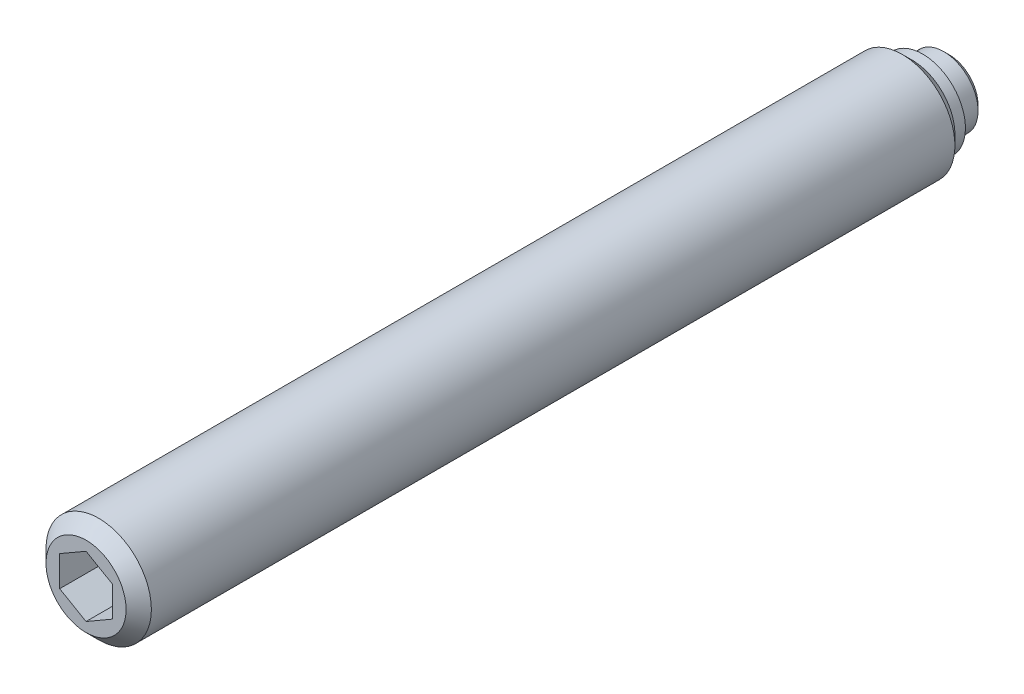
ISO-10303-21;
HEADER;
FILE_DESCRIPTION(('STEP AP214'),'2;1');
FILE_NAME('part.step','',(''),(''),'','','');
FILE_SCHEMA(('AUTOMOTIVE_DESIGN { 1 0 10303 214 1 1 1 1 }'));
ENDSEC;
DATA;
#1=APPLICATION_CONTEXT('core data for automotive mechanical design processes');
#2=APPLICATION_PROTOCOL_DEFINITION('international standard','automotive_design',2000,#1);
#3=PRODUCT_CONTEXT('',#1,'mechanical');
#4=PRODUCT('Part','Part','',(#3));
#5=PRODUCT_RELATED_PRODUCT_CATEGORY('part','',(#4));
#6=PRODUCT_DEFINITION_FORMATION('','',#4);
#7=PRODUCT_DEFINITION_CONTEXT('part definition',#1,'design');
#8=PRODUCT_DEFINITION('design','',#6,#7);
#9=PRODUCT_DEFINITION_SHAPE('','',#8);
#10=(LENGTH_UNIT() NAMED_UNIT(*) SI_UNIT(.MILLI.,.METRE.));
#11=(NAMED_UNIT(*) PLANE_ANGLE_UNIT() SI_UNIT($,.RADIAN.));
#12=(NAMED_UNIT(*) SI_UNIT($,.STERADIAN.) SOLID_ANGLE_UNIT());
#13=UNCERTAINTY_MEASURE_WITH_UNIT(LENGTH_MEASURE(1.E-05),#10,'distance_accuracy_value','');
#14=(GEOMETRIC_REPRESENTATION_CONTEXT(3) GLOBAL_UNCERTAINTY_ASSIGNED_CONTEXT((#13)) GLOBAL_UNIT_ASSIGNED_CONTEXT((#10,
#11,#12)) REPRESENTATION_CONTEXT('',''));
#15=CARTESIAN_POINT('',(0.,0.,0.));
#16=DIRECTION('',(0.,0.,1.));
#17=DIRECTION('',(1.,0.,0.));
#18=AXIS2_PLACEMENT_3D('',#15,#16,#17);
#19=CARTESIAN_POINT('',(0.,0.,0.));
#20=DIRECTION('',(0.,0.,-1.));
#21=DIRECTION('',(-1.,0.,0.));
#22=AXIS2_PLACEMENT_3D('',#19,#20,#21);
#23=CYLINDRICAL_SURFACE('',#22,3.25);
#24=CARTESIAN_POINT('',(0.,0.,0.5));
#25=DIRECTION('',(0.,0.,-1.));
#26=DIRECTION('',(-1.,0.,0.));
#27=AXIS2_PLACEMENT_3D('',#24,#25,#26);
#28=CIRCLE('',#27,3.25);
#29=CARTESIAN_POINT('',(-3.25,0.,0.5));
#30=VERTEX_POINT('',#29);
#31=EDGE_CURVE('E133',#30,#30,#28,.T.);
#32=ORIENTED_EDGE('',*,*,#31,.F.);
#33=EDGE_LOOP('',(#32));
#34=FACE_BOUND('',#33,.T.);
#35=CARTESIAN_POINT('',(0.,0.,2.5));
#36=DIRECTION('',(0.,0.,-1.));
#37=DIRECTION('',(-1.,0.,0.));
#38=AXIS2_PLACEMENT_3D('',#35,#36,#37);
#39=CIRCLE('',#38,3.25);
#40=CARTESIAN_POINT('',(-3.25,0.,2.5));
#41=VERTEX_POINT('',#40);
#42=EDGE_CURVE('E127',#41,#41,#39,.T.);
#43=ORIENTED_EDGE('',*,*,#42,.T.);
#44=EDGE_LOOP('',(#43));
#45=FACE_BOUND('',#44,.T.);
#46=ADVANCED_FACE('F14',(#34,#45),#23,.T.);
#47=CARTESIAN_POINT('',(0.,0.,0.5));
#48=DIRECTION('',(0.,0.,1.));
#49=DIRECTION('',(1.,0.,0.));
#50=AXIS2_PLACEMENT_3D('',#47,#48,#49);
#51=CONICAL_SURFACE('',#50,3.25,0.785398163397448);
#52=CARTESIAN_POINT('',(0.,0.,0.));
#53=DIRECTION('',(0.,0.,-1.));
#54=DIRECTION('',(-1.,0.,0.));
#55=AXIS2_PLACEMENT_3D('',#52,#53,#54);
#56=CIRCLE('',#55,2.75);
#57=CARTESIAN_POINT('',(-2.75,0.,0.));
#58=VERTEX_POINT('',#57);
#59=EDGE_CURVE('E130',#58,#58,#56,.T.);
#60=ORIENTED_EDGE('',*,*,#59,.F.);
#61=EDGE_LOOP('',(#60));
#62=FACE_BOUND('',#61,.T.);
#63=ORIENTED_EDGE('',*,*,#31,.T.);
#64=EDGE_LOOP('',(#63));
#65=FACE_BOUND('',#64,.T.);
#66=ADVANCED_FACE('F159',(#62,#65),#51,.T.);
#67=CARTESIAN_POINT('',(0.,2.75,0.));
#68=DIRECTION('',(0.,0.,1.));
#69=DIRECTION('',(1.,0.,0.));
#70=AXIS2_PLACEMENT_3D('',#67,#68,#69);
#71=PLANE('',#70);
#72=ORIENTED_EDGE('',*,*,#59,.T.);
#73=EDGE_LOOP('',(#72));
#74=FACE_BOUND('',#73,.T.);
#75=ADVANCED_FACE('F165',(#74),#71,.F.);
#76=CARTESIAN_POINT('',(0.,0.,2.5));
#77=DIRECTION('',(0.,0.,-1.));
#78=DIRECTION('',(-1.,0.,0.));
#79=AXIS2_PLACEMENT_3D('',#76,#77,#78);
#80=CYLINDRICAL_SURFACE('',#79,5.);
#81=CARTESIAN_POINT('',(0.,0.,4.45));
#82=DIRECTION('',(0.,0.,-1.));
#83=DIRECTION('',(-1.,0.,0.));
#84=AXIS2_PLACEMENT_3D('',#81,#82,#83);
#85=CIRCLE('',#84,5.);
#86=CARTESIAN_POINT('',(-5.,0.,4.45));
#87=VERTEX_POINT('',#86);
#88=EDGE_CURVE('E9',#87,#87,#85,.T.);
#89=ORIENTED_EDGE('',*,*,#88,.F.);
#90=EDGE_LOOP('',(#89));
#91=FACE_BOUND('',#90,.T.);
#92=CARTESIAN_POINT('',(0.,0.,80.7));
#93=DIRECTION('',(0.,0.,1.));
#94=DIRECTION('',(1.,0.,0.));
#95=AXIS2_PLACEMENT_3D('',#92,#93,#94);
#96=CIRCLE('',#95,5.);
#97=CARTESIAN_POINT('',(5.,0.,80.7));
#98=VERTEX_POINT('',#97);
#99=EDGE_CURVE('E124',#98,#98,#96,.T.);
#100=ORIENTED_EDGE('',*,*,#99,.F.);
#101=EDGE_LOOP('',(#100));
#102=FACE_BOUND('',#101,.T.);
#103=ADVANCED_FACE('F16',(#91,#102),#80,.T.);
#104=CARTESIAN_POINT('',(0.,4.05,2.5));
#105=DIRECTION('',(0.,0.,1.));
#106=DIRECTION('',(1.,0.,0.));
#107=AXIS2_PLACEMENT_3D('',#104,#105,#106);
#108=PLANE('',#107);
#109=CARTESIAN_POINT('',(0.,0.,2.5));
#110=DIRECTION('',(0.,0.,-1.));
#111=DIRECTION('',(-1.,0.,0.));
#112=AXIS2_PLACEMENT_3D('',#109,#110,#111);
#113=CIRCLE('',#112,4.05);
#114=CARTESIAN_POINT('',(-4.05,0.,2.5));
#115=VERTEX_POINT('',#114);
#116=EDGE_CURVE('E136',#115,#115,#113,.T.);
#117=ORIENTED_EDGE('',*,*,#116,.T.);
#118=EDGE_LOOP('',(#117));
#119=FACE_BOUND('',#118,.T.);
#120=ORIENTED_EDGE('',*,*,#42,.F.);
#121=EDGE_LOOP('',(#120));
#122=FACE_BOUND('',#121,.T.);
#123=ADVANCED_FACE('F156',(#119,#122),#108,.F.);
#124=CARTESIAN_POINT('',(0.,0.,2.5));
#125=DIRECTION('',(0.,0.,-1.));
#126=DIRECTION('',(-1.,0.,0.));
#127=AXIS2_PLACEMENT_3D('',#124,#125,#126);
#128=CYLINDRICAL_SURFACE('',#127,4.05);
#129=CARTESIAN_POINT('',(0.,0.,3.5));
#130=DIRECTION('',(0.,0.,-1.));
#131=DIRECTION('',(-1.,0.,0.));
#132=AXIS2_PLACEMENT_3D('',#129,#130,#131);
#133=CIRCLE('',#132,4.05);
#134=CARTESIAN_POINT('',(-4.05,0.,3.5));
#135=VERTEX_POINT('',#134);
#136=EDGE_CURVE('E22',#135,#135,#133,.T.);
#137=ORIENTED_EDGE('',*,*,#136,.T.);
#138=EDGE_LOOP('',(#137));
#139=FACE_BOUND('',#138,.T.);
#140=ORIENTED_EDGE('',*,*,#116,.F.);
#141=EDGE_LOOP('',(#140));
#142=FACE_BOUND('',#141,.T.);
#143=ADVANCED_FACE('F141',(#139,#142),#128,.T.);
#144=CARTESIAN_POINT('',(0.,0.,4.45));
#145=DIRECTION('',(0.,0.,1.));
#146=DIRECTION('',(1.,0.,0.));
#147=AXIS2_PLACEMENT_3D('',#144,#145,#146);
#148=CONICAL_SURFACE('',#147,5.,0.785398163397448);
#149=ORIENTED_EDGE('',*,*,#88,.T.);
#150=EDGE_LOOP('',(#149));
#151=FACE_BOUND('',#150,.T.);
#152=ORIENTED_EDGE('',*,*,#136,.F.);
#153=EDGE_LOOP('',(#152));
#154=FACE_BOUND('',#153,.T.);
#155=ADVANCED_FACE('F144',(#151,#154),#148,.T.);
#156=CARTESIAN_POINT('',(0.,-3.8,81.9));
#157=DIRECTION('',(0.,0.,1.));
#158=DIRECTION('',(1.,0.,0.));
#159=AXIS2_PLACEMENT_3D('',#156,#157,#158);
#160=PLANE('',#159);
#161=DIRECTION('',(0.866025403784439,-0.5,0.));
#162=VECTOR('',#161,1.);
#163=CARTESIAN_POINT('',(-2.5,-1.44337567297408,81.9));
#164=LINE('',#163,#162);
#165=CARTESIAN_POINT('',(-2.5,-1.44337567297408,81.9));
#166=VERTEX_POINT('',#165);
#167=CARTESIAN_POINT('',(0.,-2.88675134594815,81.9));
#168=VERTEX_POINT('',#167);
#169=EDGE_CURVE('E29',#166,#168,#164,.T.);
#170=ORIENTED_EDGE('',*,*,#169,.F.);
#171=DIRECTION('',(0.,-1.,0.));
#172=VECTOR('',#171,1.);
#173=CARTESIAN_POINT('',(-2.5,1.44337567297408,81.9));
#174=LINE('',#173,#172);
#175=CARTESIAN_POINT('',(-2.5,1.44337567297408,81.9));
#176=VERTEX_POINT('',#175);
#177=EDGE_CURVE('E112',#176,#166,#174,.T.);
#178=ORIENTED_EDGE('',*,*,#177,.F.);
#179=DIRECTION('',(-0.866025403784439,-0.5,0.));
#180=VECTOR('',#179,1.);
#181=CARTESIAN_POINT('',(0.,2.88675134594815,81.9));
#182=LINE('',#181,#180);
#183=CARTESIAN_POINT('',(0.,2.88675134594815,81.9));
#184=VERTEX_POINT('',#183);
#185=EDGE_CURVE('E110',#184,#176,#182,.T.);
#186=ORIENTED_EDGE('',*,*,#185,.F.);
#187=DIRECTION('',(-0.866025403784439,0.5,0.));
#188=VECTOR('',#187,1.);
#189=CARTESIAN_POINT('',(2.5,1.44337567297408,81.9));
#190=LINE('',#189,#188);
#191=CARTESIAN_POINT('',(2.5,1.44337567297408,81.9));
#192=VERTEX_POINT('',#191);
#193=EDGE_CURVE('E77',#192,#184,#190,.T.);
#194=ORIENTED_EDGE('',*,*,#193,.F.);
#195=DIRECTION('',(0.,1.,0.));
#196=VECTOR('',#195,1.);
#197=CARTESIAN_POINT('',(2.5,-1.44337567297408,81.9));
#198=LINE('',#197,#196);
#199=CARTESIAN_POINT('',(2.5,-1.44337567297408,81.9));
#200=VERTEX_POINT('',#199);
#201=EDGE_CURVE('E106',#200,#192,#198,.T.);
#202=ORIENTED_EDGE('',*,*,#201,.F.);
#203=DIRECTION('',(0.866025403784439,0.5,0.));
#204=VECTOR('',#203,1.);
#205=CARTESIAN_POINT('',(0.,-2.88675134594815,81.9));
#206=LINE('',#205,#204);
#207=EDGE_CURVE('E103',#168,#200,#206,.T.);
#208=ORIENTED_EDGE('',*,*,#207,.F.);
#209=EDGE_LOOP('',(#170,#178,#186,#194,#202,#208));
#210=FACE_BOUND('',#209,.T.);
#211=CARTESIAN_POINT('',(0.,0.,81.9));
#212=DIRECTION('',(0.,0.,1.));
#213=DIRECTION('',(1.,0.,0.));
#214=AXIS2_PLACEMENT_3D('',#211,#212,#213);
#215=CIRCLE('',#214,3.8);
#216=CARTESIAN_POINT('',(3.8,0.,81.9));
#217=VERTEX_POINT('',#216);
#218=EDGE_CURVE('E116',#217,#217,#215,.T.);
#219=ORIENTED_EDGE('',*,*,#218,.T.);
#220=EDGE_LOOP('',(#219));
#221=FACE_BOUND('',#220,.T.);
#222=ADVANCED_FACE('F146',(#210,#221),#160,.T.);
#223=CARTESIAN_POINT('',(0.,0.,81.9));
#224=DIRECTION('',(0.,0.,-1.));
#225=DIRECTION('',(-1.,0.,0.));
#226=AXIS2_PLACEMENT_3D('',#223,#224,#225);
#227=CONICAL_SURFACE('',#226,3.8,0.785398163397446);
#228=ORIENTED_EDGE('',*,*,#99,.T.);
#229=EDGE_LOOP('',(#228));
#230=FACE_BOUND('',#229,.T.);
#231=ORIENTED_EDGE('',*,*,#218,.F.);
#232=EDGE_LOOP('',(#231));
#233=FACE_BOUND('',#232,.T.);
#234=ADVANCED_FACE('F153',(#230,#233),#227,.T.);
#235=CARTESIAN_POINT('',(-2.5,-1.44337567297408,75.9));
#236=DIRECTION('',(-0.5,-0.866025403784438,0.));
#237=DIRECTION('',(0.866025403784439,-0.5,0.));
#238=AXIS2_PLACEMENT_3D('',#235,#236,#237);
#239=PLANE('',#238);
#240=ORIENTED_EDGE('',*,*,#169,.T.);
#241=DIRECTION('',(0.,0.,1.));
#242=VECTOR('',#241,1.);
#243=CARTESIAN_POINT('',(0.,-2.88675134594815,75.9));
#244=LINE('',#243,#242);
#245=CARTESIAN_POINT('',(0.,-2.88675134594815,75.9));
#246=VERTEX_POINT('',#245);
#247=EDGE_CURVE('E59',#246,#168,#244,.T.);
#248=ORIENTED_EDGE('',*,*,#247,.F.);
#249=DIRECTION('',(0.866025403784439,-0.5,0.));
#250=VECTOR('',#249,1.);
#251=CARTESIAN_POINT('',(-2.5,-1.44337567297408,75.9));
#252=LINE('',#251,#250);
#253=CARTESIAN_POINT('',(-2.5,-1.44337567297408,75.9));
#254=VERTEX_POINT('',#253);
#255=EDGE_CURVE('E114',#254,#246,#252,.T.);
#256=ORIENTED_EDGE('',*,*,#255,.F.);
#257=DIRECTION('',(0.,0.,1.));
#258=VECTOR('',#257,1.);
#259=CARTESIAN_POINT('',(-2.5,-1.44337567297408,75.9));
#260=LINE('',#259,#258);
#261=EDGE_CURVE('E37',#254,#166,#260,.T.);
#262=ORIENTED_EDGE('',*,*,#261,.T.);
#263=EDGE_LOOP('',(#240,#248,#256,#262));
#264=FACE_BOUND('',#263,.T.);
#265=ADVANCED_FACE('F191',(#264),#239,.F.);
#266=CARTESIAN_POINT('',(-2.5,1.44337567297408,75.9));
#267=DIRECTION('',(-1.,0.,0.));
#268=DIRECTION('',(0.,0.,1.));
#269=AXIS2_PLACEMENT_3D('',#266,#267,#268);
#270=PLANE('',#269);
#271=ORIENTED_EDGE('',*,*,#177,.T.);
#272=ORIENTED_EDGE('',*,*,#261,.F.);
#273=DIRECTION('',(0.,-1.,0.));
#274=VECTOR('',#273,1.);
#275=CARTESIAN_POINT('',(-2.5,1.44337567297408,75.9));
#276=LINE('',#275,#274);
#277=CARTESIAN_POINT('',(-2.5,1.44337567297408,75.9));
#278=VERTEX_POINT('',#277);
#279=EDGE_CURVE('E89',#278,#254,#276,.T.);
#280=ORIENTED_EDGE('',*,*,#279,.F.);
#281=DIRECTION('',(0.,0.,1.));
#282=VECTOR('',#281,1.);
#283=CARTESIAN_POINT('',(-2.5,1.44337567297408,75.9));
#284=LINE('',#283,#282);
#285=EDGE_CURVE('E81',#278,#176,#284,.T.);
#286=ORIENTED_EDGE('',*,*,#285,.T.);
#287=EDGE_LOOP('',(#271,#272,#280,#286));
#288=FACE_BOUND('',#287,.T.);
#289=ADVANCED_FACE('F198',(#288),#270,.F.);
#290=CARTESIAN_POINT('',(0.,2.88675134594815,75.9));
#291=DIRECTION('',(-0.5,0.866025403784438,0.));
#292=DIRECTION('',(-0.866025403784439,-0.5,0.));
#293=AXIS2_PLACEMENT_3D('',#290,#291,#292);
#294=PLANE('',#293);
#295=ORIENTED_EDGE('',*,*,#185,.T.);
#296=ORIENTED_EDGE('',*,*,#285,.F.);
#297=DIRECTION('',(-0.866025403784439,-0.5,0.));
#298=VECTOR('',#297,1.);
#299=CARTESIAN_POINT('',(0.,2.88675134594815,75.9));
#300=LINE('',#299,#298);
#301=CARTESIAN_POINT('',(0.,2.88675134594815,75.9));
#302=VERTEX_POINT('',#301);
#303=EDGE_CURVE('E85',#302,#278,#300,.T.);
#304=ORIENTED_EDGE('',*,*,#303,.F.);
#305=DIRECTION('',(0.,0.,1.));
#306=VECTOR('',#305,1.);
#307=CARTESIAN_POINT('',(0.,2.88675134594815,75.9));
#308=LINE('',#307,#306);
#309=EDGE_CURVE('E70',#302,#184,#308,.T.);
#310=ORIENTED_EDGE('',*,*,#309,.T.);
#311=EDGE_LOOP('',(#295,#296,#304,#310));
#312=FACE_BOUND('',#311,.T.);
#313=ADVANCED_FACE('F86',(#312),#294,.F.);
#314=CARTESIAN_POINT('',(2.5,1.44337567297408,75.9));
#315=DIRECTION('',(0.5,0.866025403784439,0.));
#316=DIRECTION('',(-0.866025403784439,0.5,0.));
#317=AXIS2_PLACEMENT_3D('',#314,#315,#316);
#318=PLANE('',#317);
#319=ORIENTED_EDGE('',*,*,#193,.T.);
#320=ORIENTED_EDGE('',*,*,#309,.F.);
#321=DIRECTION('',(-0.866025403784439,0.5,0.));
#322=VECTOR('',#321,1.);
#323=CARTESIAN_POINT('',(2.5,1.44337567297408,75.9));
#324=LINE('',#323,#322);
#325=CARTESIAN_POINT('',(2.5,1.44337567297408,75.9));
#326=VERTEX_POINT('',#325);
#327=EDGE_CURVE('E74',#326,#302,#324,.T.);
#328=ORIENTED_EDGE('',*,*,#327,.F.);
#329=DIRECTION('',(0.,0.,1.));
#330=VECTOR('',#329,1.);
#331=CARTESIAN_POINT('',(2.5,1.44337567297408,75.9));
#332=LINE('',#331,#330);
#333=EDGE_CURVE('E82',#326,#192,#332,.T.);
#334=ORIENTED_EDGE('',*,*,#333,.T.);
#335=EDGE_LOOP('',(#319,#320,#328,#334));
#336=FACE_BOUND('',#335,.T.);
#337=ADVANCED_FACE('F72',(#336),#318,.F.);
#338=CARTESIAN_POINT('',(2.5,-1.44337567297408,75.9));
#339=DIRECTION('',(1.,0.,0.));
#340=DIRECTION('',(0.,1.,0.));
#341=AXIS2_PLACEMENT_3D('',#338,#339,#340);
#342=PLANE('',#341);
#343=ORIENTED_EDGE('',*,*,#201,.T.);
#344=ORIENTED_EDGE('',*,*,#333,.F.);
#345=DIRECTION('',(0.,1.,0.));
#346=VECTOR('',#345,1.);
#347=CARTESIAN_POINT('',(2.5,-1.44337567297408,75.9));
#348=LINE('',#347,#346);
#349=CARTESIAN_POINT('',(2.5,-1.44337567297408,75.9));
#350=VERTEX_POINT('',#349);
#351=EDGE_CURVE('E95',#350,#326,#348,.T.);
#352=ORIENTED_EDGE('',*,*,#351,.F.);
#353=DIRECTION('',(0.,0.,1.));
#354=VECTOR('',#353,1.);
#355=CARTESIAN_POINT('',(2.5,-1.44337567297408,75.9));
#356=LINE('',#355,#354);
#357=EDGE_CURVE('E119',#350,#200,#356,.T.);
#358=ORIENTED_EDGE('',*,*,#357,.T.);
#359=EDGE_LOOP('',(#343,#344,#352,#358));
#360=FACE_BOUND('',#359,.T.);
#361=ADVANCED_FACE('F204',(#360),#342,.F.);
#362=CARTESIAN_POINT('',(0.,-2.88675134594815,75.9));
#363=DIRECTION('',(0.5,-0.866025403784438,0.));
#364=DIRECTION('',(0.866025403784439,0.5,0.));
#365=AXIS2_PLACEMENT_3D('',#362,#363,#364);
#366=PLANE('',#365);
#367=ORIENTED_EDGE('',*,*,#207,.T.);
#368=ORIENTED_EDGE('',*,*,#357,.F.);
#369=DIRECTION('',(0.866025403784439,0.5,0.));
#370=VECTOR('',#369,1.);
#371=CARTESIAN_POINT('',(0.,-2.88675134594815,75.9));
#372=LINE('',#371,#370);
#373=EDGE_CURVE('E97',#246,#350,#372,.T.);
#374=ORIENTED_EDGE('',*,*,#373,.F.);
#375=ORIENTED_EDGE('',*,*,#247,.T.);
#376=EDGE_LOOP('',(#367,#368,#374,#375));
#377=FACE_BOUND('',#376,.T.);
#378=ADVANCED_FACE('F201',(#377),#366,.F.);
#379=CARTESIAN_POINT('',(0.,0.,75.9));
#380=DIRECTION('',(0.,0.,1.));
#381=DIRECTION('',(1.,0.,0.));
#382=AXIS2_PLACEMENT_3D('',#379,#380,#381);
#383=PLANE('',#382);
#384=ORIENTED_EDGE('',*,*,#255,.T.);
#385=ORIENTED_EDGE('',*,*,#373,.T.);
#386=ORIENTED_EDGE('',*,*,#351,.T.);
#387=ORIENTED_EDGE('',*,*,#327,.T.);
#388=ORIENTED_EDGE('',*,*,#303,.T.);
#389=ORIENTED_EDGE('',*,*,#279,.T.);
#390=EDGE_LOOP('',(#384,#385,#386,#387,#388,#389));
#391=FACE_BOUND('',#390,.T.);
#392=ADVANCED_FACE('F92',(#391),#383,.T.);
#393=CLOSED_SHELL('',(#46,#66,#75,#103,#123,#143,#155,#222,#234,#265,#289,#313,#337,#361,#378,#392));
#394=MANIFOLD_SOLID_BREP('B1',#393);
#395=ADVANCED_BREP_SHAPE_REPRESENTATION('',(#18,#394),#14);
#396=SHAPE_DEFINITION_REPRESENTATION(#9,#395);
ENDSEC;
END-ISO-10303-21;
